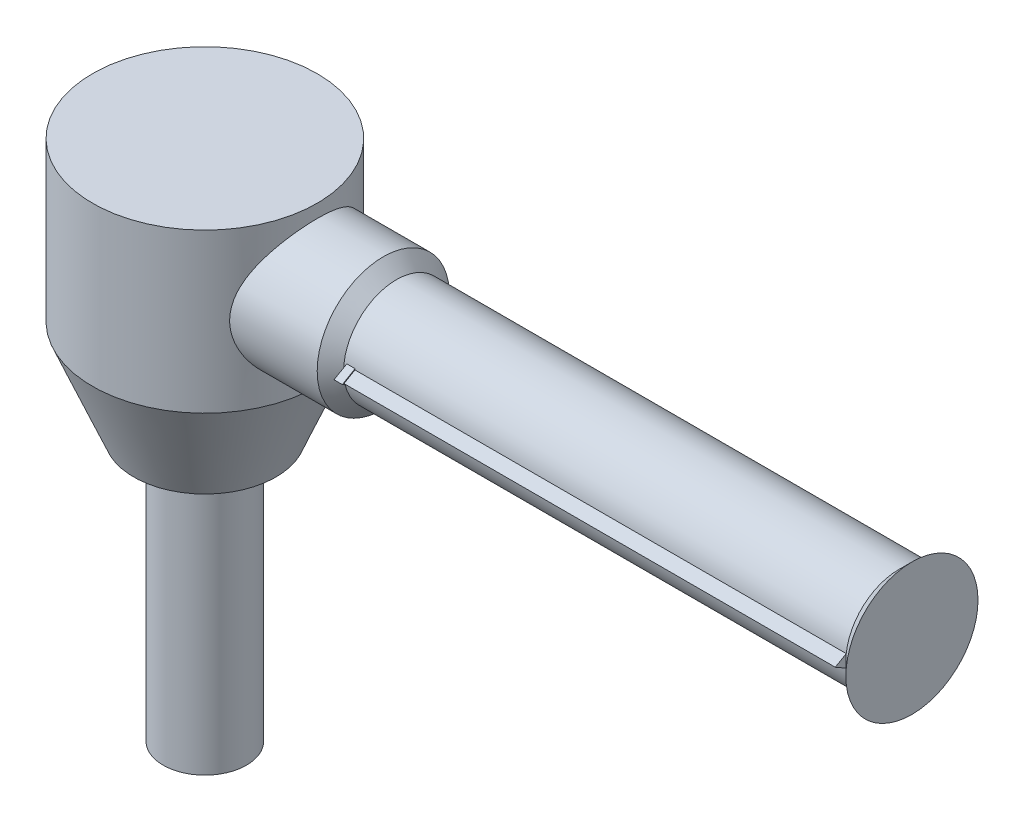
ISO-10303-21;
HEADER;
FILE_DESCRIPTION(('STEP AP214'),'2;1');
FILE_NAME('part.step','',(''),(''),'','','');
FILE_SCHEMA(('AUTOMOTIVE_DESIGN { 1 0 10303 214 1 1 1 1 }'));
ENDSEC;
DATA;
#1=APPLICATION_CONTEXT('core data for automotive mechanical design processes');
#2=APPLICATION_PROTOCOL_DEFINITION('international standard','automotive_design',2000,#1);
#3=PRODUCT_CONTEXT('',#1,'mechanical');
#4=PRODUCT('Part','Part','',(#3));
#5=PRODUCT_RELATED_PRODUCT_CATEGORY('part','',(#4));
#6=PRODUCT_DEFINITION_FORMATION('','',#4);
#7=PRODUCT_DEFINITION_CONTEXT('part definition',#1,'design');
#8=PRODUCT_DEFINITION('design','',#6,#7);
#9=PRODUCT_DEFINITION_SHAPE('','',#8);
#10=(LENGTH_UNIT() NAMED_UNIT(*) SI_UNIT(.MILLI.,.METRE.));
#11=(NAMED_UNIT(*) PLANE_ANGLE_UNIT() SI_UNIT($,.RADIAN.));
#12=(NAMED_UNIT(*) SI_UNIT($,.STERADIAN.) SOLID_ANGLE_UNIT());
#13=UNCERTAINTY_MEASURE_WITH_UNIT(LENGTH_MEASURE(1.E-05),#10,'distance_accuracy_value','');
#14=(GEOMETRIC_REPRESENTATION_CONTEXT(3) GLOBAL_UNCERTAINTY_ASSIGNED_CONTEXT((#13)) GLOBAL_UNIT_ASSIGNED_CONTEXT((#10,
#11,#12)) REPRESENTATION_CONTEXT('',''));
#15=CARTESIAN_POINT('',(0.,0.,0.));
#16=DIRECTION('',(0.,0.,1.));
#17=DIRECTION('',(1.,0.,0.));
#18=AXIS2_PLACEMENT_3D('',#15,#16,#17);
#19=CARTESIAN_POINT('',(0.,42.8625,0.));
#20=DIRECTION('',(-1.,0.,0.));
#21=DIRECTION('',(0.,0.,1.));
#22=AXIS2_PLACEMENT_3D('',#19,#20,#21);
#23=CYLINDRICAL_SURFACE('',#22,12.7);
#24=CARTESIAN_POINT('',(46.0375,42.8625,0.));
#25=DIRECTION('',(-1.,0.,0.));
#26=DIRECTION('',(0.,0.,1.));
#27=AXIS2_PLACEMENT_3D('',#24,#25,#26);
#28=CIRCLE('',#27,12.7);
#29=CARTESIAN_POINT('',(46.0375,42.8625,12.7));
#30=VERTEX_POINT('',#29);
#31=EDGE_CURVE('E236',#30,#30,#28,.T.);
#32=ORIENTED_EDGE('',*,*,#31,.F.);
#33=EDGE_LOOP('',(#32));
#34=FACE_BOUND('',#33,.T.);
#35=CARTESIAN_POINT('',(48.6725000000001,42.8625,0.));
#36=DIRECTION('',(-1.,0.,0.));
#37=DIRECTION('',(0.,0.,1.));
#38=AXIS2_PLACEMENT_3D('',#35,#36,#37);
#39=CIRCLE('',#38,12.7);
#40=CARTESIAN_POINT('',(48.6725000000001,44.5780709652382,-12.5835931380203));
#41=VERTEX_POINT('',#40);
#42=CARTESIAN_POINT('',(48.6725000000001,44.3289696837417,-12.6150492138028));
#43=VERTEX_POINT('',#42);
#44=EDGE_CURVE('E52',#41,#43,#39,.T.);
#45=ORIENTED_EDGE('',*,*,#44,.F.);
#46=DIRECTION('',(-1.,0.,0.));
#47=VECTOR('',#46,1.);
#48=CARTESIAN_POINT('',(0.,44.5780709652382,-12.5835931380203));
#49=LINE('',#48,#47);
#50=CARTESIAN_POINT('',(46.6725000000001,44.5780709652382,-12.5835931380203));
#51=VERTEX_POINT('',#50);
#52=EDGE_CURVE('E12',#41,#51,#49,.T.);
#53=ORIENTED_EDGE('',*,*,#52,.T.);
#54=CARTESIAN_POINT('',(46.6725000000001,42.8625,0.));
#55=DIRECTION('',(1.,0.,0.));
#56=DIRECTION('',(0.,0.,-1.));
#57=AXIS2_PLACEMENT_3D('',#54,#55,#56);
#58=CIRCLE('',#57,12.7);
#59=CARTESIAN_POINT('',(46.6725000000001,41.1469290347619,-12.5835931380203));
#60=VERTEX_POINT('',#59);
#61=EDGE_CURVE('E60',#60,#51,#58,.T.);
#62=ORIENTED_EDGE('',*,*,#61,.F.);
#63=DIRECTION('',(-1.,0.,0.));
#64=VECTOR('',#63,1.);
#65=CARTESIAN_POINT('',(0.,41.1469290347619,-12.5835931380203));
#66=LINE('',#65,#64);
#67=CARTESIAN_POINT('',(48.6725000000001,41.1469290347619,-12.5835931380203));
#68=VERTEX_POINT('',#67);
#69=EDGE_CURVE('E46',#60,#68,#66,.F.);
#70=ORIENTED_EDGE('',*,*,#69,.T.);
#71=CARTESIAN_POINT('',(48.6725000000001,41.3960303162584,-12.6150492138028));
#72=VERTEX_POINT('',#71);
#73=EDGE_CURVE('E142',#72,#68,#39,.T.);
#74=ORIENTED_EDGE('',*,*,#73,.F.);
#75=DIRECTION('',(1.,0.,0.));
#76=VECTOR('',#75,1.);
#77=CARTESIAN_POINT('',(46.6725000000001,41.3960303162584,-12.6150492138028));
#78=LINE('',#77,#76);
#79=CARTESIAN_POINT('',(166.6875,41.3960303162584,-12.6150492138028));
#80=VERTEX_POINT('',#79);
#81=EDGE_CURVE('E185',#72,#80,#78,.T.);
#82=ORIENTED_EDGE('',*,*,#81,.T.);
#83=CARTESIAN_POINT('',(166.6875,42.8625,0.));
#84=DIRECTION('',(-1.,0.,0.));
#85=DIRECTION('',(0.,0.,1.));
#86=AXIS2_PLACEMENT_3D('',#83,#84,#85);
#87=CIRCLE('',#86,12.7);
#88=CARTESIAN_POINT('',(166.6875,41.3433864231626,12.6088181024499));
#89=VERTEX_POINT('',#88);
#90=EDGE_CURVE('E238',#80,#89,#87,.T.);
#91=ORIENTED_EDGE('',*,*,#90,.T.);
#92=DIRECTION('',(1.,0.,0.));
#93=VECTOR('',#92,1.);
#94=CARTESIAN_POINT('',(46.6725000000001,41.3433864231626,12.6088181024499));
#95=LINE('',#94,#93);
#96=CARTESIAN_POINT('',(48.6725000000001,41.3433864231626,12.6088181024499));
#97=VERTEX_POINT('',#96);
#98=EDGE_CURVE('E196',#97,#89,#95,.T.);
#99=ORIENTED_EDGE('',*,*,#98,.F.);
#100=CARTESIAN_POINT('',(48.6725000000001,42.8625,0.));
#101=DIRECTION('',(-1.,0.,0.));
#102=DIRECTION('',(0.,0.,1.));
#103=AXIS2_PLACEMENT_3D('',#100,#101,#102);
#104=CIRCLE('',#103,12.7);
#105=CARTESIAN_POINT('',(48.6725000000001,41.0936201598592,12.5762102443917));
#106=VERTEX_POINT('',#105);
#107=EDGE_CURVE('E174',#106,#97,#104,.T.);
#108=ORIENTED_EDGE('',*,*,#107,.F.);
#109=DIRECTION('',(-1.,0.,0.));
#110=VECTOR('',#109,1.);
#111=CARTESIAN_POINT('',(0.,41.0936201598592,12.5762102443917));
#112=LINE('',#111,#110);
#113=CARTESIAN_POINT('',(46.6725000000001,41.0936201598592,12.5762102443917));
#114=VERTEX_POINT('',#113);
#115=EDGE_CURVE('E613',#106,#114,#112,.T.);
#116=ORIENTED_EDGE('',*,*,#115,.T.);
#117=CARTESIAN_POINT('',(46.6725000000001,42.8625,0.));
#118=DIRECTION('',(-1.,0.,0.));
#119=DIRECTION('',(0.,0.,1.));
#120=AXIS2_PLACEMENT_3D('',#117,#118,#119);
#121=CIRCLE('',#120,12.7);
#122=CARTESIAN_POINT('',(46.6725000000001,44.6313798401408,12.5762102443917));
#123=VERTEX_POINT('',#122);
#124=EDGE_CURVE('E610',#114,#123,#121,.T.);
#125=ORIENTED_EDGE('',*,*,#124,.T.);
#126=DIRECTION('',(-1.,0.,0.));
#127=VECTOR('',#126,1.);
#128=CARTESIAN_POINT('',(0.,44.6313798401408,12.5762102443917));
#129=LINE('',#128,#127);
#130=CARTESIAN_POINT('',(48.6725000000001,44.6313798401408,12.5762102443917));
#131=VERTEX_POINT('',#130);
#132=EDGE_CURVE('E617',#123,#131,#129,.F.);
#133=ORIENTED_EDGE('',*,*,#132,.T.);
#134=CARTESIAN_POINT('',(48.6725000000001,44.3816135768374,12.6088181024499));
#135=VERTEX_POINT('',#134);
#136=EDGE_CURVE('E177',#135,#131,#104,.T.);
#137=ORIENTED_EDGE('',*,*,#136,.F.);
#138=DIRECTION('',(1.,0.,0.));
#139=VECTOR('',#138,1.);
#140=CARTESIAN_POINT('',(46.6725000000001,44.3816135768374,12.6088181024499));
#141=LINE('',#140,#139);
#142=CARTESIAN_POINT('',(166.6875,44.3816135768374,12.6088181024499));
#143=VERTEX_POINT('',#142);
#144=EDGE_CURVE('E200',#135,#143,#141,.T.);
#145=ORIENTED_EDGE('',*,*,#144,.T.);
#146=CARTESIAN_POINT('',(166.6875,44.3289696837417,-12.6150492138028));
#147=VERTEX_POINT('',#146);
#148=EDGE_CURVE('E233',#143,#147,#87,.T.);
#149=ORIENTED_EDGE('',*,*,#148,.T.);
#150=DIRECTION('',(1.,0.,0.));
#151=VECTOR('',#150,1.);
#152=CARTESIAN_POINT('',(46.6725000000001,44.3289696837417,-12.6150492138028));
#153=LINE('',#152,#151);
#154=EDGE_CURVE('E188',#43,#147,#153,.T.);
#155=ORIENTED_EDGE('',*,*,#154,.F.);
#156=EDGE_LOOP('',(#45,#53,#62,#70,#74,#82,#91,#99,#108,#116,#125,#133,#137,#145,#149,#155));
#157=FACE_BOUND('',#156,.T.);
#158=ADVANCED_FACE('F38',(#34,#157),#23,.T.);
#159=CARTESIAN_POINT('',(46.6725000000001,42.8625,-15.1550492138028));
#160=DIRECTION('',(0.,-0.866025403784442,-0.499999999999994));
#161=DIRECTION('',(0.,0.499999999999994,-0.866025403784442));
#162=AXIS2_PLACEMENT_3D('',#159,#160,#161);
#163=PLANE('',#162);
#164=ORIENTED_EDGE('',*,*,#81,.F.);
#165=DIRECTION('',(0.,-0.499999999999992,0.866025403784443));
#166=VECTOR('',#165,1.);
#167=CARTESIAN_POINT('',(48.6725000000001,42.8625,-15.1550492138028));
#168=LINE('',#167,#166);
#169=CARTESIAN_POINT('',(48.6725000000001,42.8625,-15.1550492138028));
#170=VERTEX_POINT('',#169);
#171=EDGE_CURVE('E152',#170,#72,#168,.T.);
#172=ORIENTED_EDGE('',*,*,#171,.F.);
#173=DIRECTION('',(1.,0.,0.));
#174=VECTOR('',#173,1.);
#175=CARTESIAN_POINT('',(46.6725000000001,42.8625,-15.1550492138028));
#176=LINE('',#175,#174);
#177=CARTESIAN_POINT('',(166.6875,42.8625,-15.1550492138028));
#178=VERTEX_POINT('',#177);
#179=EDGE_CURVE('E184',#170,#178,#176,.T.);
#180=ORIENTED_EDGE('',*,*,#179,.T.);
#181=DIRECTION('',(0.,0.499999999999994,-0.866025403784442));
#182=VECTOR('',#181,1.);
#183=CARTESIAN_POINT('',(166.6875,42.8625,-15.1550492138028));
#184=LINE('',#183,#182);
#185=EDGE_CURVE('E178',#80,#178,#184,.T.);
#186=ORIENTED_EDGE('',*,*,#185,.F.);
#187=EDGE_LOOP('',(#164,#172,#180,#186));
#188=FACE_BOUND('',#187,.T.);
#189=ADVANCED_FACE('F282',(#188),#163,.T.);
#190=CARTESIAN_POINT('',(46.6725000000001,42.8625,-15.1550492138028));
#191=DIRECTION('',(0.,0.866025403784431,-0.500000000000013));
#192=DIRECTION('',(0.,0.500000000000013,0.866025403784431));
#193=AXIS2_PLACEMENT_3D('',#190,#191,#192);
#194=PLANE('',#193);
#195=ORIENTED_EDGE('',*,*,#179,.F.);
#196=DIRECTION('',(0.,-0.500000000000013,-0.866025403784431));
#197=VECTOR('',#196,1.);
#198=CARTESIAN_POINT('',(48.6725000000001,44.3289696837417,-12.6150492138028));
#199=LINE('',#198,#197);
#200=EDGE_CURVE('E624',#43,#170,#199,.T.);
#201=ORIENTED_EDGE('',*,*,#200,.F.);
#202=ORIENTED_EDGE('',*,*,#154,.T.);
#203=DIRECTION('',(0.,0.500000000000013,0.866025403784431));
#204=VECTOR('',#203,1.);
#205=CARTESIAN_POINT('',(166.6875,42.8625,-15.1550492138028));
#206=LINE('',#205,#204);
#207=EDGE_CURVE('E181',#178,#147,#206,.T.);
#208=ORIENTED_EDGE('',*,*,#207,.F.);
#209=EDGE_LOOP('',(#195,#201,#202,#208));
#210=FACE_BOUND('',#209,.T.);
#211=ADVANCED_FACE('F287',(#210),#194,.T.);
#212=CARTESIAN_POINT('',(46.6725000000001,42.8625,15.24));
#213=DIRECTION('',(0.,-0.866025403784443,0.499999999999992));
#214=DIRECTION('',(0.,-0.499999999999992,-0.866025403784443));
#215=AXIS2_PLACEMENT_3D('',#212,#213,#214);
#216=PLANE('',#215);
#217=DIRECTION('',(1.,0.,0.));
#218=VECTOR('',#217,1.);
#219=CARTESIAN_POINT('',(46.6725000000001,42.8625,15.24));
#220=LINE('',#219,#218);
#221=CARTESIAN_POINT('',(48.6725000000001,42.8625,15.24));
#222=VERTEX_POINT('',#221);
#223=CARTESIAN_POINT('',(166.6875,42.8625,15.24));
#224=VERTEX_POINT('',#223);
#225=EDGE_CURVE('E197',#222,#224,#220,.T.);
#226=ORIENTED_EDGE('',*,*,#225,.F.);
#227=DIRECTION('',(0.,0.499999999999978,0.866025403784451));
#228=VECTOR('',#227,1.);
#229=CARTESIAN_POINT('',(48.6725000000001,41.3433864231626,12.6088181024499));
#230=LINE('',#229,#228);
#231=EDGE_CURVE('E155',#97,#222,#230,.T.);
#232=ORIENTED_EDGE('',*,*,#231,.F.);
#233=ORIENTED_EDGE('',*,*,#98,.T.);
#234=DIRECTION('',(0.,-0.499999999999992,-0.866025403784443));
#235=VECTOR('',#234,1.);
#236=CARTESIAN_POINT('',(166.6875,42.8625,15.24));
#237=LINE('',#236,#235);
#238=EDGE_CURVE('E187',#224,#89,#237,.T.);
#239=ORIENTED_EDGE('',*,*,#238,.F.);
#240=EDGE_LOOP('',(#226,#232,#233,#239));
#241=FACE_BOUND('',#240,.T.);
#242=ADVANCED_FACE('F333',(#241),#216,.T.);
#243=CARTESIAN_POINT('',(46.6725000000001,42.8625,15.24));
#244=DIRECTION('',(0.,0.866025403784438,0.500000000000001));
#245=DIRECTION('',(0.,-0.500000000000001,0.866025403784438));
#246=AXIS2_PLACEMENT_3D('',#243,#244,#245);
#247=PLANE('',#246);
#248=ORIENTED_EDGE('',*,*,#144,.F.);
#249=DIRECTION('',(0.,0.500000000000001,-0.866025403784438));
#250=VECTOR('',#249,1.);
#251=CARTESIAN_POINT('',(48.6725000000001,42.8625,15.24));
#252=LINE('',#251,#250);
#253=EDGE_CURVE('E158',#222,#135,#252,.T.);
#254=ORIENTED_EDGE('',*,*,#253,.F.);
#255=ORIENTED_EDGE('',*,*,#225,.T.);
#256=DIRECTION('',(0.,-0.500000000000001,0.866025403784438));
#257=VECTOR('',#256,1.);
#258=CARTESIAN_POINT('',(166.6875,42.8625,15.24));
#259=LINE('',#258,#257);
#260=EDGE_CURVE('E193',#143,#224,#259,.T.);
#261=ORIENTED_EDGE('',*,*,#260,.F.);
#262=EDGE_LOOP('',(#248,#254,#255,#261));
#263=FACE_BOUND('',#262,.T.);
#264=ADVANCED_FACE('F336',(#263),#247,.T.);
#265=CARTESIAN_POINT('',(0.,0.,0.));
#266=DIRECTION('',(0.,-1.,0.));
#267=DIRECTION('',(0.,0.,-1.));
#268=AXIS2_PLACEMENT_3D('',#265,#266,#267);
#269=PLANE('',#268);
#270=CARTESIAN_POINT('',(0.,0.,0.));
#271=DIRECTION('',(0.,-1.,0.));
#272=DIRECTION('',(0.,0.,-1.));
#273=AXIS2_PLACEMENT_3D('',#270,#271,#272);
#274=CIRCLE('',#273,11.9844698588);
#275=CARTESIAN_POINT('',(0.,0.,-11.9844698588));
#276=VERTEX_POINT('',#275);
#277=EDGE_CURVE('E215',#276,#276,#274,.T.);
#278=ORIENTED_EDGE('',*,*,#277,.T.);
#279=EDGE_LOOP('',(#278));
#280=FACE_BOUND('',#279,.T.);
#281=CARTESIAN_POINT('',(0.,0.,0.));
#282=DIRECTION('',(0.,-1.,0.));
#283=DIRECTION('',(0.,0.,-1.));
#284=AXIS2_PLACEMENT_3D('',#281,#282,#283);
#285=CIRCLE('',#284,10.);
#286=CARTESIAN_POINT('',(0.,0.,-10.));
#287=VERTEX_POINT('',#286);
#288=EDGE_CURVE('E205',#287,#287,#285,.T.);
#289=ORIENTED_EDGE('',*,*,#288,.F.);
#290=EDGE_LOOP('',(#289));
#291=FACE_BOUND('',#290,.T.);
#292=ADVANCED_FACE('F340',(#280,#291),#269,.T.);
#293=CARTESIAN_POINT('',(0.,0.,0.));
#294=DIRECTION('',(0.,-1.,0.));
#295=DIRECTION('',(0.,0.,-1.));
#296=AXIS2_PLACEMENT_3D('',#293,#294,#295);
#297=CYLINDRICAL_SURFACE('',#296,26.9875);
#298=CARTESIAN_POINT('',(0.,23.8125,0.));
#299=DIRECTION('',(0.,-1.,0.));
#300=DIRECTION('',(0.,0.,-1.));
#301=AXIS2_PLACEMENT_3D('',#298,#299,#300);
#302=CIRCLE('',#301,26.9875);
#303=CARTESIAN_POINT('',(0.,23.8125,-26.9875));
#304=VERTEX_POINT('',#303);
#305=EDGE_CURVE('E248',#304,#304,#302,.T.);
#306=ORIENTED_EDGE('',*,*,#305,.F.);
#307=EDGE_LOOP('',(#306));
#308=FACE_BOUND('',#307,.T.);
#309=CARTESIAN_POINT('',(0.,61.9125,0.));
#310=DIRECTION('',(0.,-1.,0.));
#311=DIRECTION('',(0.,0.,-1.));
#312=AXIS2_PLACEMENT_3D('',#309,#310,#311);
#313=CIRCLE('',#312,26.9875);
#314=CARTESIAN_POINT('',(0.,61.9125,-26.9875));
#315=VERTEX_POINT('',#314);
#316=EDGE_CURVE('E245',#315,#315,#313,.T.);
#317=ORIENTED_EDGE('',*,*,#316,.T.);
#318=EDGE_LOOP('',(#317));
#319=FACE_BOUND('',#318,.T.);
#320=CARTESIAN_POINT('',(21.8245167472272,42.8625,15.875));
#321=CARTESIAN_POINT('',(21.8245157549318,43.2637830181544,15.8750007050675));
#322=CARTESIAN_POINT('',(21.8356248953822,43.6650577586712,15.8597622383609));
#323=CARTESIAN_POINT('',(21.8795680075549,44.4640981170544,15.7990838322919));
#324=CARTESIAN_POINT('',(21.9124017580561,44.861863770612,15.7536442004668));
#325=CARTESIAN_POINT('',(21.9984369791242,45.6509994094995,15.633277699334));
#326=CARTESIAN_POINT('',(22.0516564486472,46.0423634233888,15.5583247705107));
#327=CARTESIAN_POINT('',(22.1763546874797,46.815577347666,15.380060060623));
#328=CARTESIAN_POINT('',(22.2478341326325,47.1974269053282,15.2767472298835));
#329=CARTESIAN_POINT('',(22.4059138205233,47.9466541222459,15.0439292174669));
#330=CARTESIAN_POINT('',(22.4924014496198,48.3141162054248,14.9146180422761));
#331=CARTESIAN_POINT('',(22.6781525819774,49.0358924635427,14.6306298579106));
#332=CARTESIAN_POINT('',(22.7774208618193,49.3902016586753,14.4759433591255));
#333=CARTESIAN_POINT('',(22.9859352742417,50.0842215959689,14.142509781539));
#334=CARTESIAN_POINT('',(23.0951812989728,50.4239324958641,13.9637629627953));
#335=CARTESIAN_POINT('',(23.3209448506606,51.0877277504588,13.583357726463));
#336=CARTESIAN_POINT('',(23.437462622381,51.4118115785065,13.3816985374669));
#337=CARTESIAN_POINT('',(23.689115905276,52.0805027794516,12.9315496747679));
#338=CARTESIAN_POINT('',(23.8248329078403,52.4230637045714,12.6803414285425));
#339=CARTESIAN_POINT('',(24.0986461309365,53.0863169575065,12.1519114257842));
#340=CARTESIAN_POINT('',(24.2367418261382,53.4070140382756,11.8746953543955));
#341=CARTESIAN_POINT('',(24.5122237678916,54.0256694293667,11.2950905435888));
#342=CARTESIAN_POINT('',(24.6496093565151,54.3236092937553,10.9926817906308));
#343=CARTESIAN_POINT('',(24.9204742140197,54.8951145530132,10.3639902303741));
#344=CARTESIAN_POINT('',(25.0539532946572,55.1686787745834,10.0377062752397));
#345=CARTESIAN_POINT('',(25.3273987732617,55.7166680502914,9.32776190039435));
#346=CARTESIAN_POINT('',(25.4666246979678,55.9882991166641,8.94164981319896));
#347=CARTESIAN_POINT('',(25.7329076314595,56.4977544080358,8.14368056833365));
#348=CARTESIAN_POINT('',(25.859963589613,56.7355757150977,7.73182119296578));
#349=CARTESIAN_POINT('',(26.098179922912,57.1747139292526,6.88501662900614));
#350=CARTESIAN_POINT('',(26.2093509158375,57.3760552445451,6.45008713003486));
#351=CARTESIAN_POINT('',(26.412508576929,57.7397931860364,5.55993071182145));
#352=CARTESIAN_POINT('',(26.5044982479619,57.9021959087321,5.10470698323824));
#353=CARTESIAN_POINT('',(26.6588421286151,58.1724788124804,4.2206213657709));
#354=CARTESIAN_POINT('',(26.7231506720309,58.2840130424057,3.79321665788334));
#355=CARTESIAN_POINT('',(26.8317187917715,58.4713900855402,2.92813601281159));
#356=CARTESIAN_POINT('',(26.8759794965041,58.5472349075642,2.49046065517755));
#357=CARTESIAN_POINT('',(26.9431163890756,58.6619985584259,1.60899579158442));
#358=CARTESIAN_POINT('',(26.9660085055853,58.7009448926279,1.16521109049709));
#359=CARTESIAN_POINT('',(26.9897637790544,58.7413569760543,0.275365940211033));
#360=CARTESIAN_POINT('',(26.9906290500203,58.7428263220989,-0.17069428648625));
#361=CARTESIAN_POINT('',(26.9715339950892,58.7103461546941,-1.00760232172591));
#362=CARTESIAN_POINT('',(26.9540496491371,58.6806076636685,-1.39867896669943));
#363=CARTESIAN_POINT('',(26.9024182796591,58.59246696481,-2.17644162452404));
#364=CARTESIAN_POINT('',(26.8682729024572,58.5340675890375,-2.56312806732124));
#365=CARTESIAN_POINT('',(26.7841072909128,58.3893262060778,-3.3294710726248));
#366=CARTESIAN_POINT('',(26.7340865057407,58.3029832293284,-3.70912739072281));
#367=CARTESIAN_POINT('',(26.619285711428,58.1033498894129,-4.45899957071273));
#368=CARTESIAN_POINT('',(26.5545051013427,57.9900584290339,-4.82921504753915));
#369=CARTESIAN_POINT('',(26.4110625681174,57.7368287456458,-5.56064893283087));
#370=CARTESIAN_POINT('',(26.3323060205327,57.5967083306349,-5.92178553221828));
#371=CARTESIAN_POINT('',(26.1628449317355,57.2916719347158,-6.63049519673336));
#372=CARTESIAN_POINT('',(26.0721404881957,57.1267561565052,-6.97806837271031));
#373=CARTESIAN_POINT('',(25.8805365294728,56.7734550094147,-7.65818715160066));
#374=CARTESIAN_POINT('',(25.779635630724,56.5850664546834,-7.99073070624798));
#375=CARTESIAN_POINT('',(25.5695168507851,56.1861409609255,-8.63951777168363));
#376=CARTESIAN_POINT('',(25.4602981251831,55.9756017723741,-8.95575962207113));
#377=CARTESIAN_POINT('',(25.2223562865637,55.5077722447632,-9.60685407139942));
#378=CARTESIAN_POINT('',(25.0928455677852,55.2478938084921,-9.93956139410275));
#379=CARTESIAN_POINT('',(24.828712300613,54.7036167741,-10.5821024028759));
#380=CARTESIAN_POINT('',(24.6940894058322,54.419216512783,-10.8919345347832));
#381=CARTESIAN_POINT('',(24.422504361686,53.8269215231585,-11.4879859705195));
#382=CARTESIAN_POINT('',(24.2855395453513,53.5189984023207,-11.7741758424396));
#383=CARTESIAN_POINT('',(24.0125136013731,52.8811996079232,-12.3214396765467));
#384=CARTESIAN_POINT('',(23.8764525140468,52.5513229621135,-12.5825125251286));
#385=CARTESIAN_POINT('',(23.5938307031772,51.8335493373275,-13.1054959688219));
#386=CARTESIAN_POINT('',(23.4477471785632,51.4432511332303,-13.3643811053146));
#387=CARTESIAN_POINT('',(23.1653838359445,50.6385779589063,-13.8480543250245));
#388=CARTESIAN_POINT('',(23.0291055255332,50.2241993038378,-14.0728371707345));
#389=CARTESIAN_POINT('',(22.7715655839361,49.3739167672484,-14.4858594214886));
#390=CARTESIAN_POINT('',(22.6502817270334,48.9380461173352,-14.6741531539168));
#391=CARTESIAN_POINT('',(22.427662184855,48.0467452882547,-15.012200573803));
#392=CARTESIAN_POINT('',(22.3263190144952,47.5913225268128,-15.1619687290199));
#393=CARTESIAN_POINT('',(22.1698606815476,46.7756533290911,-15.3894969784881));
#394=CARTESIAN_POINT('',(22.1094883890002,46.418808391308,-15.4759123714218));
#395=CARTESIAN_POINT('',(22.0050161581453,45.6977005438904,-15.6241055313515));
#396=CARTESIAN_POINT('',(21.9609136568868,45.3334388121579,-15.6858871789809));
#397=CARTESIAN_POINT('',(21.8905412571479,44.6001207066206,-15.7839480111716));
#398=CARTESIAN_POINT('',(21.864255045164,44.2310690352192,-15.820250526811));
#399=CARTESIAN_POINT('',(21.8304153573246,43.4904520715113,-15.8669141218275));
#400=CARTESIAN_POINT('',(21.8228623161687,43.1188867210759,-15.8772745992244));
#401=CARTESIAN_POINT('',(21.8267794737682,42.3756712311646,-15.8718891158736));
#402=CARTESIAN_POINT('',(21.8382689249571,42.0040213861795,-15.85611673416));
#403=CARTESIAN_POINT('',(21.8798723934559,41.263794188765,-15.798657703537));
#404=CARTESIAN_POINT('',(21.9099864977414,40.8952168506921,-15.7569709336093));
#405=CARTESIAN_POINT('',(21.98776466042,40.163474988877,-15.6482526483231));
#406=CARTESIAN_POINT('',(22.0354400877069,39.80031413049,-15.5812047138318));
#407=CARTESIAN_POINT('',(22.1467068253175,39.0818808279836,-15.4226421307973));
#408=CARTESIAN_POINT('',(22.2102986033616,38.7266086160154,-15.3311267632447));
#409=CARTESIAN_POINT('',(22.3517272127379,38.0242049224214,-15.1241926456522));
#410=CARTESIAN_POINT('',(22.4296277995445,37.6771180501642,-15.0086665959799));
#411=CARTESIAN_POINT('',(22.5972884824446,36.9941466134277,-14.7550266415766));
#412=CARTESIAN_POINT('',(22.6870524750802,36.6582657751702,-14.6169053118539));
#413=CARTESIAN_POINT('',(22.8761461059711,35.9989517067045,-14.3191545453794));
#414=CARTESIAN_POINT('',(22.9754765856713,35.6755195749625,-14.1595232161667));
#415=CARTESIAN_POINT('',(23.1814424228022,35.0420473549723,-13.8197450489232));
#416=CARTESIAN_POINT('',(23.2880781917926,34.7320080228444,-13.639597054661));
#417=CARTESIAN_POINT('',(23.5255931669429,34.0730583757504,-13.2264086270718));
#418=CARTESIAN_POINT('',(23.6574494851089,33.7268393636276,-12.9896288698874));
#419=CARTESIAN_POINT('',(23.9248441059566,33.0551793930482,-12.4902840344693));
#420=CARTESIAN_POINT('',(24.0603817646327,32.7297348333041,-12.2277234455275));
#421=CARTESIAN_POINT('',(24.332127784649,32.100364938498,-11.6776241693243));
#422=CARTESIAN_POINT('',(24.4683366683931,31.7964607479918,-11.3900615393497));
#423=CARTESIAN_POINT('',(24.7382739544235,31.2117524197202,-10.7912390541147));
#424=CARTESIAN_POINT('',(24.8720022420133,30.9309493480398,-10.4799781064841));
#425=CARTESIAN_POINT('',(25.1494606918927,30.3623215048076,-9.79699223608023));
#426=CARTESIAN_POINT('',(25.2925251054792,30.077533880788,-9.42245700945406));
#427=CARTESIAN_POINT('',(25.5680741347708,29.5407154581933,-8.64685592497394));
#428=CARTESIAN_POINT('',(25.7005577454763,29.288687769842,-8.24578755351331));
#429=CARTESIAN_POINT('',(25.9511574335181,28.8199845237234,-7.41949074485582));
#430=CARTESIAN_POINT('',(26.0692812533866,28.6032898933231,-6.99427551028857));
#431=CARTESIAN_POINT('',(26.2877421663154,28.2077035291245,-6.12223026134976));
#432=CARTESIAN_POINT('',(26.3880817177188,28.028806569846,-5.67540324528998));
#433=CARTESIAN_POINT('',(26.5609144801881,27.7235696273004,-4.79864560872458));
#434=CARTESIAN_POINT('',(26.6349560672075,27.5942452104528,-4.37005952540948));
#435=CARTESIAN_POINT('',(26.7631009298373,27.3717826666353,-3.50065416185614));
#436=CARTESIAN_POINT('',(26.8172050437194,27.2786430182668,-3.05983539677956));
#437=CARTESIAN_POINT('',(26.9038119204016,27.1300746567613,-2.17017048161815));
#438=CARTESIAN_POINT('',(26.9363330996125,27.0746137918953,-1.72133151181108));
#439=CARTESIAN_POINT('',(26.9788292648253,27.0022171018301,-0.819513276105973));
#440=CARTESIAN_POINT('',(26.9888068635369,26.9852768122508,-0.366534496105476));
#441=CARTESIAN_POINT('',(26.9861002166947,26.9898809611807,0.481764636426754));
#442=CARTESIAN_POINT('',(26.9761236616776,27.0068270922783,0.877128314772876));
#443=CARTESIAN_POINT('',(26.9389945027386,27.0700790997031,1.66465419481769));
#444=CARTESIAN_POINT('',(26.9118436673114,27.1163819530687,2.0568167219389));
#445=CARTESIAN_POINT('',(26.8410116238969,27.2377505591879,2.8351331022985));
#446=CARTESIAN_POINT('',(26.797330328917,27.3128164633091,3.22128692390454));
#447=CARTESIAN_POINT('',(26.6944445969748,27.4908016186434,3.98500479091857));
#448=CARTESIAN_POINT('',(26.6352396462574,27.5937217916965,4.36256855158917));
#449=CARTESIAN_POINT('',(26.5031734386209,27.8252916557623,5.10367090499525));
#450=CARTESIAN_POINT('',(26.4304307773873,27.9537185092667,5.46730051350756));
#451=CARTESIAN_POINT('',(26.2724773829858,28.2355674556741,6.18190960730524));
#452=CARTESIAN_POINT('',(26.1872668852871,28.3889890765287,6.53288933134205));
#453=CARTESIAN_POINT('',(26.0060393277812,28.7195281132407,7.22063427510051));
#454=CARTESIAN_POINT('',(25.9100211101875,28.8966480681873,7.5573979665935));
#455=CARTESIAN_POINT('',(25.7089718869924,29.2732741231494,8.21536929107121));
#456=CARTESIAN_POINT('',(25.6039399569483,29.4727825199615,8.53657532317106));
#457=CARTESIAN_POINT('',(25.3748408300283,29.9159619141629,9.19660959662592));
#458=CARTESIAN_POINT('',(25.2499489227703,30.1620765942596,9.53351225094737));
#459=CARTESIAN_POINT('',(24.9940540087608,30.6787576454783,10.1855342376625));
#460=CARTESIAN_POINT('',(24.863050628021,30.9493255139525,10.5006522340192));
#461=CARTESIAN_POINT('',(24.5975625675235,31.5138144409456,11.1083358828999));
#462=CARTESIAN_POINT('',(24.4630742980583,31.8077602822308,11.4008769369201));
#463=CARTESIAN_POINT('',(24.1936464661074,32.4175106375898,11.9620027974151));
#464=CARTESIAN_POINT('',(24.0587068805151,32.7333162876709,12.2305863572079));
#465=CARTESIAN_POINT('',(23.7756181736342,33.4242166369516,12.7729959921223));
#466=CARTESIAN_POINT('',(23.6277915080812,33.8019082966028,13.0436938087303));
#467=CARTESIAN_POINT('',(23.339867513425,34.5817287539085,13.5521635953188));
#468=CARTESIAN_POINT('',(23.1997712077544,34.9838607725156,13.789931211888));
#469=CARTESIAN_POINT('',(22.9322313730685,35.8105150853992,14.230400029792));
#470=CARTESIAN_POINT('',(22.8047778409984,36.2350192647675,14.4331290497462));
#471=CARTESIAN_POINT('',(22.5674318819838,37.1045340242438,14.8014944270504));
#472=CARTESIAN_POINT('',(22.4575352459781,37.5495396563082,14.967139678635));
#473=CARTESIAN_POINT('',(22.2748354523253,38.3902099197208,15.2374346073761));
#474=CARTESIAN_POINT('',(22.1989521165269,38.7834736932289,15.3474768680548));
#475=CARTESIAN_POINT('',(22.0664312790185,39.5804093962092,15.5374135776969));
#476=CARTESIAN_POINT('',(22.0097915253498,39.9840801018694,15.6173115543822));
#477=CARTESIAN_POINT('',(21.9181917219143,40.7982902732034,15.7456110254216));
#478=CARTESIAN_POINT('',(21.8832024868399,41.2088197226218,15.7940549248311));
#479=CARTESIAN_POINT('',(21.8363658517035,42.033735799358,15.858748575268));
#480=CARTESIAN_POINT('',(21.8245177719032,42.448122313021,15.8749992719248));
#481=CARTESIAN_POINT('',(21.8245167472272,42.8625,15.875));
#482=B_SPLINE_CURVE_WITH_KNOTS('',3,(#320,#321,#322,#323,#324,#325,#326,#327,#328,#329,#330,
#331,#332,#333,#334,#335,#336,#337,#338,#339,#340,#341,#342,#343,#344,#345,#346,#347,#348,#349,
#350,#351,#352,#353,#354,#355,#356,#357,#358,#359,#360,#361,#362,#363,#364,#365,#366,#367,#368,
#369,#370,#371,#372,#373,#374,#375,#376,#377,#378,#379,#380,#381,#382,#383,#384,#385,#386,#387,
#388,#389,#390,#391,#392,#393,#394,#395,#396,#397,#398,#399,#400,#401,#402,#403,#404,#405,#406,
#407,#408,#409,#410,#411,#412,#413,#414,#415,#416,#417,#418,#419,#420,#421,#422,#423,#424,#425,
#426,#427,#428,#429,#430,#431,#432,#433,#434,#435,#436,#437,#438,#439,#440,#441,#442,#443,#444,
#445,#446,#447,#448,#449,#450,#451,#452,#453,#454,#455,#456,#457,#458,#459,#460,#461,#462,#463,
#464,#465,#466,#467,#468,#469,#470,#471,#472,#473,#474,#475,#476,#477,#478,#479,#480,#481),
.UNSPECIFIED.,.T.,.F.,(4,2,2,2,2,2,2,2,2,2,2,2,2,2,2,2,2,2,2,2,2,2,2,2,2,2,2,2,2,2,2,2,2,2,2,2,
2,2,2,2,2,2,2,2,2,2,2,2,2,2,2,2,2,2,2,2,2,2,2,2,2,2,2,2,2,2,2,2,2,2,2,2,2,2,2,2,2,2,2,2,4),(0.,
1.20339844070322,2.40678462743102,3.61123576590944,4.81573149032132,6.0115519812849,
7.20782069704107,8.40407648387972,9.60037255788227,10.9368797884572,12.2730955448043,
13.6103831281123,14.9477350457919,16.4223612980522,17.8971147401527,19.3708777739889,
20.8444099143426,22.1816239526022,23.5187627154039,24.8549039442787,26.1909169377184,
27.3672972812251,28.5435614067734,29.7198663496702,30.8962191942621,32.0808635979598,
33.2654983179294,34.4502939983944,35.635210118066,36.9586265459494,38.2821328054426,
39.6072626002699,40.9324511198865,42.4024384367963,43.8726512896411,45.3406580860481,
46.8081127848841,47.9232420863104,49.038195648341,50.1521269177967,51.2660840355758,
52.3811680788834,53.4962573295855,54.612069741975,55.7279149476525,56.8488582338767,
57.9701706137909,59.0915817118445,60.2130560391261,61.5307685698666,62.8482520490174,
64.1670113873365,65.4858315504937,66.9592852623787,68.4328787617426,69.905674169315,
71.3782658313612,72.7375723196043,74.0968216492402,75.4549096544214,76.8128402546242,
77.9989500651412,79.1849377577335,80.3709316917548,81.5569648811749,82.7330592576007,
83.9091314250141,85.0853297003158,86.2616487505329,87.5668612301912,88.8721536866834,
90.178848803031,91.48561187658,92.9467328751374,94.4080468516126,95.8681952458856,
97.3279930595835,98.5725241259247,99.8169095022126,101.059613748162,102.302281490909),.UNSPECIFIED.);
#483=CARTESIAN_POINT('',(21.8245167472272,42.8625,15.875));
#484=VERTEX_POINT('',#483);
#485=EDGE_CURVE('E244',#484,#484,#482,.T.);
#486=ORIENTED_EDGE('',*,*,#485,.T.);
#487=EDGE_LOOP('',(#486));
#488=FACE_BOUND('',#487,.T.);
#489=ADVANCED_FACE('F262',(#308,#319,#488),#297,.T.);
#490=CARTESIAN_POINT('',(0.,0.,0.));
#491=DIRECTION('',(0.,-1.,0.));
#492=DIRECTION('',(0.,0.,-1.));
#493=AXIS2_PLACEMENT_3D('',#490,#491,#492);
#494=CIRCLE('',#493,14.5752698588);
#495=CARTESIAN_POINT('',(0.,0.,-14.5752698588));
#496=VERTEX_POINT('',#495);
#497=EDGE_CURVE('E222',#496,#496,#494,.T.);
#498=ORIENTED_EDGE('',*,*,#497,.F.);
#499=EDGE_LOOP('',(#498));
#500=FACE_BOUND('',#499,.T.);
#501=CARTESIAN_POINT('',(0.,0.,0.));
#502=DIRECTION('',(0.,-1.,0.));
#503=DIRECTION('',(0.,0.,-1.));
#504=AXIS2_PLACEMENT_3D('',#501,#502,#503);
#505=CIRCLE('',#504,17.0898698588);
#506=CARTESIAN_POINT('',(0.,0.,-17.0898698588));
#507=VERTEX_POINT('',#506);
#508=EDGE_CURVE('E251',#507,#507,#505,.T.);
#509=ORIENTED_EDGE('',*,*,#508,.T.);
#510=EDGE_LOOP('',(#509));
#511=FACE_BOUND('',#510,.T.);
#512=ADVANCED_FACE('F40',(#500,#511),#269,.T.);
#513=CARTESIAN_POINT('',(0.,0.,0.));
#514=DIRECTION('',(0.,1.,0.));
#515=DIRECTION('',(0.,0.,1.));
#516=AXIS2_PLACEMENT_3D('',#513,#514,#515);
#517=CONICAL_SURFACE('',#516,17.0898698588,0.393923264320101);
#518=ORIENTED_EDGE('',*,*,#305,.T.);
#519=EDGE_LOOP('',(#518));
#520=FACE_BOUND('',#519,.T.);
#521=ORIENTED_EDGE('',*,*,#508,.F.);
#522=EDGE_LOOP('',(#521));
#523=FACE_BOUND('',#522,.T.);
#524=ADVANCED_FACE('F274',(#520,#523),#517,.T.);
#525=CARTESIAN_POINT('',(26.9875,61.9125,0.));
#526=DIRECTION('',(0.,1.,0.));
#527=DIRECTION('',(0.,0.,1.));
#528=AXIS2_PLACEMENT_3D('',#525,#526,#527);
#529=PLANE('',#528);
#530=ORIENTED_EDGE('',*,*,#316,.F.);
#531=EDGE_LOOP('',(#530));
#532=FACE_BOUND('',#531,.T.);
#533=ADVANCED_FACE('F270',(#532),#529,.T.);
#534=CARTESIAN_POINT('',(0.,42.8625,0.));
#535=DIRECTION('',(-1.,0.,0.));
#536=DIRECTION('',(0.,0.,1.));
#537=AXIS2_PLACEMENT_3D('',#534,#535,#536);
#538=CYLINDRICAL_SURFACE('',#537,15.875);
#539=ORIENTED_EDGE('',*,*,#485,.F.);
#540=EDGE_LOOP('',(#539));
#541=FACE_BOUND('',#540,.T.);
#542=CARTESIAN_POINT('',(42.8625,42.8625,0.));
#543=DIRECTION('',(-1.,0.,0.));
#544=DIRECTION('',(0.,0.,1.));
#545=AXIS2_PLACEMENT_3D('',#542,#543,#544);
#546=CIRCLE('',#545,15.875);
#547=CARTESIAN_POINT('',(42.8625,42.8625,15.875));
#548=VERTEX_POINT('',#547);
#549=EDGE_CURVE('E241',#548,#548,#546,.T.);
#550=ORIENTED_EDGE('',*,*,#549,.T.);
#551=EDGE_LOOP('',(#550));
#552=FACE_BOUND('',#551,.T.);
#553=ADVANCED_FACE('F265',(#541,#552),#538,.T.);
#554=CARTESIAN_POINT('',(46.0375,42.8625,0.));
#555=DIRECTION('',(-1.,0.,0.));
#556=DIRECTION('',(0.,0.,1.));
#557=AXIS2_PLACEMENT_3D('',#554,#555,#556);
#558=CONICAL_SURFACE('',#557,12.7,0.785398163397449);
#559=ORIENTED_EDGE('',*,*,#549,.F.);
#560=EDGE_LOOP('',(#559));
#561=FACE_BOUND('',#560,.T.);
#562=ORIENTED_EDGE('',*,*,#31,.T.);
#563=EDGE_LOOP('',(#562));
#564=FACE_BOUND('',#563,.T.);
#565=ADVANCED_FACE('F269',(#561,#564),#558,.T.);
#566=CARTESIAN_POINT('',(169.8625,42.8625,0.));
#567=DIRECTION('',(1.,0.,0.));
#568=DIRECTION('',(0.,0.,-1.));
#569=AXIS2_PLACEMENT_3D('',#566,#567,#568);
#570=CONICAL_SURFACE('',#569,15.875,0.785398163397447);
#571=ORIENTED_EDGE('',*,*,#148,.F.);
#572=EDGE_CURVE('E232',#89,#143,#87,.T.);
#573=ORIENTED_EDGE('',*,*,#572,.F.);
#574=ORIENTED_EDGE('',*,*,#90,.F.);
#575=EDGE_CURVE('E237',#147,#80,#87,.T.);
#576=ORIENTED_EDGE('',*,*,#575,.F.);
#577=EDGE_LOOP('',(#571,#573,#574,#576));
#578=FACE_BOUND('',#577,.T.);
#579=CARTESIAN_POINT('',(169.8625,42.8625,0.));
#580=DIRECTION('',(-1.,0.,0.));
#581=DIRECTION('',(0.,0.,1.));
#582=AXIS2_PLACEMENT_3D('',#579,#580,#581);
#583=CIRCLE('',#582,15.875);
#584=CARTESIAN_POINT('',(169.8625,42.8625,15.875));
#585=VERTEX_POINT('',#584);
#586=EDGE_CURVE('E225',#585,#585,#583,.T.);
#587=ORIENTED_EDGE('',*,*,#586,.T.);
#588=EDGE_LOOP('',(#587));
#589=FACE_BOUND('',#588,.T.);
#590=ADVANCED_FACE('F292',(#578,#589),#570,.T.);
#591=CARTESIAN_POINT('',(169.8625,42.8625,0.));
#592=DIRECTION('',(-1.,0.,0.));
#593=DIRECTION('',(0.,0.,1.));
#594=AXIS2_PLACEMENT_3D('',#591,#592,#593);
#595=PLANE('',#594);
#596=ORIENTED_EDGE('',*,*,#586,.F.);
#597=EDGE_LOOP('',(#596));
#598=FACE_BOUND('',#597,.T.);
#599=ADVANCED_FACE('F295',(#598),#595,.F.);
#600=CARTESIAN_POINT('',(0.,60.96,0.));
#601=DIRECTION('',(0.,-1.,0.));
#602=DIRECTION('',(0.,0.,-1.));
#603=AXIS2_PLACEMENT_3D('',#600,#601,#602);
#604=CYLINDRICAL_SURFACE('',#603,11.9844698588);
#605=CARTESIAN_POINT('',(0.,60.96,0.));
#606=DIRECTION('',(0.,-1.,0.));
#607=DIRECTION('',(0.,0.,-1.));
#608=AXIS2_PLACEMENT_3D('',#605,#606,#607);
#609=CIRCLE('',#608,11.9844698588);
#610=CARTESIAN_POINT('',(0.,60.96,-11.9844698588));
#611=VERTEX_POINT('',#610);
#612=EDGE_CURVE('E218',#611,#611,#609,.T.);
#613=ORIENTED_EDGE('',*,*,#612,.T.);
#614=EDGE_LOOP('',(#613));
#615=FACE_BOUND('',#614,.T.);
#616=ORIENTED_EDGE('',*,*,#277,.F.);
#617=EDGE_LOOP('',(#616));
#618=FACE_BOUND('',#617,.T.);
#619=ADVANCED_FACE('F299',(#615,#618),#604,.T.);
#620=CARTESIAN_POINT('',(0.,60.96,0.));
#621=DIRECTION('',(0.,-1.,0.));
#622=DIRECTION('',(0.,0.,-1.));
#623=AXIS2_PLACEMENT_3D('',#620,#621,#622);
#624=CYLINDRICAL_SURFACE('',#623,14.5752698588);
#625=CARTESIAN_POINT('',(0.,60.96,0.));
#626=DIRECTION('',(0.,-1.,0.));
#627=DIRECTION('',(0.,0.,-1.));
#628=AXIS2_PLACEMENT_3D('',#625,#626,#627);
#629=CIRCLE('',#628,14.5752698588);
#630=CARTESIAN_POINT('',(0.,60.96,-14.5752698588));
#631=VERTEX_POINT('',#630);
#632=EDGE_CURVE('E221',#631,#631,#629,.T.);
#633=ORIENTED_EDGE('',*,*,#632,.F.);
#634=EDGE_LOOP('',(#633));
#635=FACE_BOUND('',#634,.T.);
#636=ORIENTED_EDGE('',*,*,#497,.T.);
#637=EDGE_LOOP('',(#636));
#638=FACE_BOUND('',#637,.T.);
#639=ADVANCED_FACE('F303',(#635,#638),#624,.F.);
#640=CARTESIAN_POINT('',(0.,60.96,-37.7391350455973));
#641=DIRECTION('',(0.,-1.,0.));
#642=DIRECTION('',(0.,0.,-1.));
#643=AXIS2_PLACEMENT_3D('',#640,#641,#642);
#644=PLANE('',#643);
#645=ORIENTED_EDGE('',*,*,#612,.F.);
#646=EDGE_LOOP('',(#645));
#647=FACE_BOUND('',#646,.T.);
#648=ORIENTED_EDGE('',*,*,#632,.T.);
#649=EDGE_LOOP('',(#648));
#650=FACE_BOUND('',#649,.T.);
#651=ADVANCED_FACE('F307',(#647,#650),#644,.T.);
#652=CARTESIAN_POINT('',(0.,-63.5,0.));
#653=DIRECTION('',(0.,-1.,0.));
#654=DIRECTION('',(0.,0.,-1.));
#655=AXIS2_PLACEMENT_3D('',#652,#653,#654);
#656=PLANE('',#655);
#657=CARTESIAN_POINT('',(0.,-63.5,0.));
#658=DIRECTION('',(0.,-1.,0.));
#659=DIRECTION('',(0.,0.,-1.));
#660=AXIS2_PLACEMENT_3D('',#657,#658,#659);
#661=CIRCLE('',#660,10.);
#662=CARTESIAN_POINT('',(0.,-63.5,-10.));
#663=VERTEX_POINT('',#662);
#664=EDGE_CURVE('E206',#663,#663,#661,.T.);
#665=ORIENTED_EDGE('',*,*,#664,.T.);
#666=EDGE_LOOP('',(#665));
#667=FACE_BOUND('',#666,.T.);
#668=CARTESIAN_POINT('',(0.,-63.5,0.));
#669=DIRECTION('',(0.,-1.,0.));
#670=DIRECTION('',(0.,0.,-1.));
#671=AXIS2_PLACEMENT_3D('',#668,#669,#670);
#672=CIRCLE('',#671,6.);
#673=CARTESIAN_POINT('',(0.,-63.5,-6.));
#674=VERTEX_POINT('',#673);
#675=EDGE_CURVE('E199',#674,#674,#672,.T.);
#676=ORIENTED_EDGE('',*,*,#675,.F.);
#677=EDGE_LOOP('',(#676));
#678=FACE_BOUND('',#677,.T.);
#679=ADVANCED_FACE('F311',(#667,#678),#656,.T.);
#680=CARTESIAN_POINT('',(0.,-63.5,0.));
#681=DIRECTION('',(0.,1.,0.));
#682=DIRECTION('',(0.,0.,1.));
#683=AXIS2_PLACEMENT_3D('',#680,#681,#682);
#684=CYLINDRICAL_SURFACE('',#683,10.);
#685=ORIENTED_EDGE('',*,*,#664,.F.);
#686=EDGE_LOOP('',(#685));
#687=FACE_BOUND('',#686,.T.);
#688=ORIENTED_EDGE('',*,*,#288,.T.);
#689=EDGE_LOOP('',(#688));
#690=FACE_BOUND('',#689,.T.);
#691=ADVANCED_FACE('F323',(#687,#690),#684,.T.);
#692=CARTESIAN_POINT('',(0.,-63.5,0.));
#693=DIRECTION('',(0.,1.,0.));
#694=DIRECTION('',(0.,0.,1.));
#695=AXIS2_PLACEMENT_3D('',#692,#693,#694);
#696=CYLINDRICAL_SURFACE('',#695,6.);
#697=ORIENTED_EDGE('',*,*,#675,.T.);
#698=EDGE_LOOP('',(#697));
#699=FACE_BOUND('',#698,.T.);
#700=CARTESIAN_POINT('',(0.,0.,0.));
#701=DIRECTION('',(0.,-1.,0.));
#702=DIRECTION('',(0.,0.,-1.));
#703=AXIS2_PLACEMENT_3D('',#700,#701,#702);
#704=CIRCLE('',#703,6.);
#705=CARTESIAN_POINT('',(0.,0.,-6.));
#706=VERTEX_POINT('',#705);
#707=EDGE_CURVE('E254',#706,#706,#704,.F.);
#708=ORIENTED_EDGE('',*,*,#707,.T.);
#709=EDGE_LOOP('',(#708));
#710=FACE_BOUND('',#709,.T.);
#711=ADVANCED_FACE('F321',(#699,#710),#696,.F.);
#712=CARTESIAN_POINT('',(0.,60.96,-37.7391350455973));
#713=DIRECTION('',(0.,-1.,0.));
#714=DIRECTION('',(0.,0.,-1.));
#715=AXIS2_PLACEMENT_3D('',#712,#713,#714);
#716=PLANE('',#715);
#717=CARTESIAN_POINT('',(0.,60.96,0.));
#718=DIRECTION('',(0.,-1.,0.));
#719=DIRECTION('',(0.,0.,-1.));
#720=AXIS2_PLACEMENT_3D('',#717,#718,#719);
#721=CIRCLE('',#720,3.2004);
#722=CARTESIAN_POINT('',(0.,60.96,-3.2004));
#723=VERTEX_POINT('',#722);
#724=EDGE_CURVE('E212',#723,#723,#721,.T.);
#725=ORIENTED_EDGE('',*,*,#724,.T.);
#726=EDGE_LOOP('',(#725));
#727=FACE_BOUND('',#726,.T.);
#728=ADVANCED_FACE('F317',(#727),#716,.T.);
#729=CARTESIAN_POINT('',(0.,60.96,0.));
#730=DIRECTION('',(0.,-1.,0.));
#731=DIRECTION('',(0.,0.,-1.));
#732=AXIS2_PLACEMENT_3D('',#729,#730,#731);
#733=CYLINDRICAL_SURFACE('',#732,3.2004);
#734=ORIENTED_EDGE('',*,*,#724,.F.);
#735=EDGE_LOOP('',(#734));
#736=FACE_BOUND('',#735,.T.);
#737=CARTESIAN_POINT('',(0.,0.,0.));
#738=DIRECTION('',(0.,-1.,0.));
#739=DIRECTION('',(0.,0.,-1.));
#740=AXIS2_PLACEMENT_3D('',#737,#738,#739);
#741=CIRCLE('',#740,3.2004);
#742=CARTESIAN_POINT('',(0.,0.,-3.2004));
#743=VERTEX_POINT('',#742);
#744=EDGE_CURVE('E209',#743,#743,#741,.T.);
#745=ORIENTED_EDGE('',*,*,#744,.T.);
#746=EDGE_LOOP('',(#745));
#747=FACE_BOUND('',#746,.T.);
#748=ADVANCED_FACE('F313',(#736,#747),#733,.F.);
#749=ORIENTED_EDGE('',*,*,#707,.F.);
#750=EDGE_LOOP('',(#749));
#751=FACE_BOUND('',#750,.T.);
#752=ORIENTED_EDGE('',*,*,#744,.F.);
#753=EDGE_LOOP('',(#752));
#754=FACE_BOUND('',#753,.T.);
#755=ADVANCED_FACE('F316',(#751,#754),#269,.T.);
#756=CARTESIAN_POINT('',(46.6725000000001,41.3433864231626,12.6088181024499));
#757=DIRECTION('',(-1.,0.,0.));
#758=DIRECTION('',(0.,0.,1.));
#759=AXIS2_PLACEMENT_3D('',#756,#757,#758);
#760=PLANE('',#759);
#761=ORIENTED_EDGE('',*,*,#124,.F.);
#762=DIRECTION('',(0.,0.499999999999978,0.866025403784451));
#763=VECTOR('',#762,1.);
#764=CARTESIAN_POINT('',(46.6725000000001,40.9660812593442,12.3553063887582));
#765=LINE('',#764,#763);
#766=CARTESIAN_POINT('',(46.6725000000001,42.8625,15.64));
#767=VERTEX_POINT('',#766);
#768=EDGE_CURVE('E161',#114,#767,#765,.T.);
#769=ORIENTED_EDGE('',*,*,#768,.T.);
#770=DIRECTION('',(0.,0.500000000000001,-0.866025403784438));
#771=VECTOR('',#770,1.);
#772=CARTESIAN_POINT('',(46.6725000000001,42.8625,15.64));
#773=LINE('',#772,#771);
#774=EDGE_CURVE('E165',#767,#123,#773,.T.);
#775=ORIENTED_EDGE('',*,*,#774,.T.);
#776=EDGE_LOOP('',(#761,#769,#775));
#777=FACE_BOUND('',#776,.T.);
#778=ADVANCED_FACE('F346',(#777),#760,.T.);
#779=CARTESIAN_POINT('',(166.6875,41.3433864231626,12.6088181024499));
#780=DIRECTION('',(-1.,0.,0.));
#781=DIRECTION('',(0.,0.,1.));
#782=AXIS2_PLACEMENT_3D('',#779,#780,#781);
#783=PLANE('',#782);
#784=ORIENTED_EDGE('',*,*,#238,.T.);
#785=ORIENTED_EDGE('',*,*,#572,.T.);
#786=ORIENTED_EDGE('',*,*,#260,.T.);
#787=EDGE_LOOP('',(#784,#785,#786));
#788=FACE_BOUND('',#787,.T.);
#789=ADVANCED_FACE('F342',(#788),#783,.F.);
#790=CARTESIAN_POINT('',(46.6725000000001,41.3960303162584,-12.6150492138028));
#791=DIRECTION('',(1.,0.,0.));
#792=DIRECTION('',(0.,0.,-1.));
#793=AXIS2_PLACEMENT_3D('',#790,#791,#792);
#794=PLANE('',#793);
#795=DIRECTION('',(0.,-0.499999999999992,0.866025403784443));
#796=VECTOR('',#795,1.);
#797=CARTESIAN_POINT('',(46.6725000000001,42.8625,-15.5550492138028));
#798=LINE('',#797,#796);
#799=CARTESIAN_POINT('',(46.6725000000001,42.8625,-15.5550492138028));
#800=VERTEX_POINT('',#799);
#801=EDGE_CURVE('E136',#800,#60,#798,.T.);
#802=ORIENTED_EDGE('',*,*,#801,.T.);
#803=ORIENTED_EDGE('',*,*,#61,.T.);
#804=DIRECTION('',(0.,-0.500000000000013,-0.866025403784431));
#805=VECTOR('',#804,1.);
#806=CARTESIAN_POINT('',(46.6725000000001,44.7051791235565,-12.3634353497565));
#807=LINE('',#806,#805);
#808=EDGE_CURVE('E150',#51,#800,#807,.T.);
#809=ORIENTED_EDGE('',*,*,#808,.T.);
#810=EDGE_LOOP('',(#802,#803,#809));
#811=FACE_BOUND('',#810,.T.);
#812=ADVANCED_FACE('F345',(#811),#794,.F.);
#813=CARTESIAN_POINT('',(166.6875,41.3960303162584,-12.6150492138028));
#814=DIRECTION('',(1.,0.,0.));
#815=DIRECTION('',(0.,0.,-1.));
#816=AXIS2_PLACEMENT_3D('',#813,#814,#815);
#817=PLANE('',#816);
#818=ORIENTED_EDGE('',*,*,#575,.T.);
#819=ORIENTED_EDGE('',*,*,#185,.T.);
#820=ORIENTED_EDGE('',*,*,#207,.T.);
#821=EDGE_LOOP('',(#818,#819,#820));
#822=FACE_BOUND('',#821,.T.);
#823=ADVANCED_FACE('F354',(#822),#817,.T.);
#824=CARTESIAN_POINT('',(48.6725000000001,42.8625,15.64));
#825=DIRECTION('',(0.,0.866025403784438,0.500000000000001));
#826=DIRECTION('',(0.,-0.500000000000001,0.866025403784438));
#827=AXIS2_PLACEMENT_3D('',#824,#825,#826);
#828=PLANE('',#827);
#829=ORIENTED_EDGE('',*,*,#132,.F.);
#830=ORIENTED_EDGE('',*,*,#774,.F.);
#831=DIRECTION('',(-1.,0.,0.));
#832=VECTOR('',#831,1.);
#833=CARTESIAN_POINT('',(48.6725000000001,42.8625,15.64));
#834=LINE('',#833,#832);
#835=CARTESIAN_POINT('',(48.6725000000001,42.8625,15.64));
#836=VERTEX_POINT('',#835);
#837=EDGE_CURVE('E168',#836,#767,#834,.T.);
#838=ORIENTED_EDGE('',*,*,#837,.F.);
#839=DIRECTION('',(0.,0.500000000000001,-0.866025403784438));
#840=VECTOR('',#839,1.);
#841=CARTESIAN_POINT('',(48.6725000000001,42.8625,15.64));
#842=LINE('',#841,#840);
#843=EDGE_CURVE('E164',#836,#131,#842,.T.);
#844=ORIENTED_EDGE('',*,*,#843,.T.);
#845=EDGE_LOOP('',(#829,#830,#838,#844));
#846=FACE_BOUND('',#845,.T.);
#847=ADVANCED_FACE('F357',(#846),#828,.T.);
#848=CARTESIAN_POINT('',(48.6725000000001,40.9660812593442,12.3553063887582));
#849=DIRECTION('',(0.,-0.866025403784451,0.499999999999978));
#850=DIRECTION('',(0.,-0.499999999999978,-0.866025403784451));
#851=AXIS2_PLACEMENT_3D('',#848,#849,#850);
#852=PLANE('',#851);
#853=ORIENTED_EDGE('',*,*,#115,.F.);
#854=DIRECTION('',(0.,0.499999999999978,0.866025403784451));
#855=VECTOR('',#854,1.);
#856=CARTESIAN_POINT('',(48.6725000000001,40.9660812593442,12.3553063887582));
#857=LINE('',#856,#855);
#858=EDGE_CURVE('E162',#106,#836,#857,.T.);
#859=ORIENTED_EDGE('',*,*,#858,.T.);
#860=ORIENTED_EDGE('',*,*,#837,.T.);
#861=ORIENTED_EDGE('',*,*,#768,.F.);
#862=EDGE_LOOP('',(#853,#859,#860,#861));
#863=FACE_BOUND('',#862,.T.);
#864=ADVANCED_FACE('F361',(#863),#852,.T.);
#865=CARTESIAN_POINT('',(48.6725000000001,42.8625,0.));
#866=DIRECTION('',(-1.,0.,0.));
#867=DIRECTION('',(0.,0.,1.));
#868=AXIS2_PLACEMENT_3D('',#865,#866,#867);
#869=PLANE('',#868);
#870=ORIENTED_EDGE('',*,*,#253,.T.);
#871=ORIENTED_EDGE('',*,*,#136,.T.);
#872=ORIENTED_EDGE('',*,*,#843,.F.);
#873=ORIENTED_EDGE('',*,*,#858,.F.);
#874=ORIENTED_EDGE('',*,*,#107,.T.);
#875=ORIENTED_EDGE('',*,*,#231,.T.);
#876=EDGE_LOOP('',(#870,#871,#872,#873,#874,#875));
#877=FACE_BOUND('',#876,.T.);
#878=ADVANCED_FACE('F364',(#877),#869,.F.);
#879=CARTESIAN_POINT('',(48.6725000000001,44.7051791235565,-12.3634353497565));
#880=DIRECTION('',(0.,0.866025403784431,-0.500000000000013));
#881=DIRECTION('',(0.,0.500000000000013,0.866025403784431));
#882=AXIS2_PLACEMENT_3D('',#879,#880,#881);
#883=PLANE('',#882);
#884=ORIENTED_EDGE('',*,*,#52,.F.);
#885=DIRECTION('',(0.,-0.500000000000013,-0.866025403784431));
#886=VECTOR('',#885,1.);
#887=CARTESIAN_POINT('',(48.6725000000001,44.7051791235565,-12.3634353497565));
#888=LINE('',#887,#886);
#889=CARTESIAN_POINT('',(48.6725000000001,42.8625,-15.5550492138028));
#890=VERTEX_POINT('',#889);
#891=EDGE_CURVE('E127',#41,#890,#888,.T.);
#892=ORIENTED_EDGE('',*,*,#891,.T.);
#893=DIRECTION('',(-1.,0.,0.));
#894=VECTOR('',#893,1.);
#895=CARTESIAN_POINT('',(48.6725000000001,42.8625,-15.5550492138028));
#896=LINE('',#895,#894);
#897=EDGE_CURVE('E131',#890,#800,#896,.T.);
#898=ORIENTED_EDGE('',*,*,#897,.T.);
#899=ORIENTED_EDGE('',*,*,#808,.F.);
#900=EDGE_LOOP('',(#884,#892,#898,#899));
#901=FACE_BOUND('',#900,.T.);
#902=ADVANCED_FACE('F129',(#901),#883,.T.);
#903=CARTESIAN_POINT('',(48.6725000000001,42.8625,-15.5550492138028));
#904=DIRECTION('',(0.,-0.866025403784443,-0.499999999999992));
#905=DIRECTION('',(0.,0.499999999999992,-0.866025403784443));
#906=AXIS2_PLACEMENT_3D('',#903,#904,#905);
#907=PLANE('',#906);
#908=ORIENTED_EDGE('',*,*,#69,.F.);
#909=ORIENTED_EDGE('',*,*,#801,.F.);
#910=ORIENTED_EDGE('',*,*,#897,.F.);
#911=DIRECTION('',(0.,-0.499999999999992,0.866025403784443));
#912=VECTOR('',#911,1.);
#913=CARTESIAN_POINT('',(48.6725000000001,42.8625,-15.5550492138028));
#914=LINE('',#913,#912);
#915=EDGE_CURVE('E135',#890,#68,#914,.T.);
#916=ORIENTED_EDGE('',*,*,#915,.T.);
#917=EDGE_LOOP('',(#908,#909,#910,#916));
#918=FACE_BOUND('',#917,.T.);
#919=ADVANCED_FACE('F141',(#918),#907,.T.);
#920=CARTESIAN_POINT('',(48.6725000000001,42.8625,0.));
#921=DIRECTION('',(-1.,0.,0.));
#922=DIRECTION('',(0.,0.,1.));
#923=AXIS2_PLACEMENT_3D('',#920,#921,#922);
#924=PLANE('',#923);
#925=ORIENTED_EDGE('',*,*,#891,.F.);
#926=ORIENTED_EDGE('',*,*,#44,.T.);
#927=ORIENTED_EDGE('',*,*,#200,.T.);
#928=ORIENTED_EDGE('',*,*,#171,.T.);
#929=ORIENTED_EDGE('',*,*,#73,.T.);
#930=ORIENTED_EDGE('',*,*,#915,.F.);
#931=EDGE_LOOP('',(#925,#926,#927,#928,#929,#930));
#932=FACE_BOUND('',#931,.T.);
#933=ADVANCED_FACE('F145',(#932),#924,.F.);
#934=CLOSED_SHELL('',(#158,#189,#211,#242,#264,#292,#489,#512,#524,#533,#553,#565,#590,#599,
#619,#639,#651,#679,#691,#711,#728,#748,#755,#778,#789,#812,#823,#847,#864,#878,#902,#919,#933));
#935=MANIFOLD_SOLID_BREP('B2',#934);
#936=ADVANCED_BREP_SHAPE_REPRESENTATION('',(#18,#935),#14);
#937=SHAPE_DEFINITION_REPRESENTATION(#9,#936);
ENDSEC;
END-ISO-10303-21;
